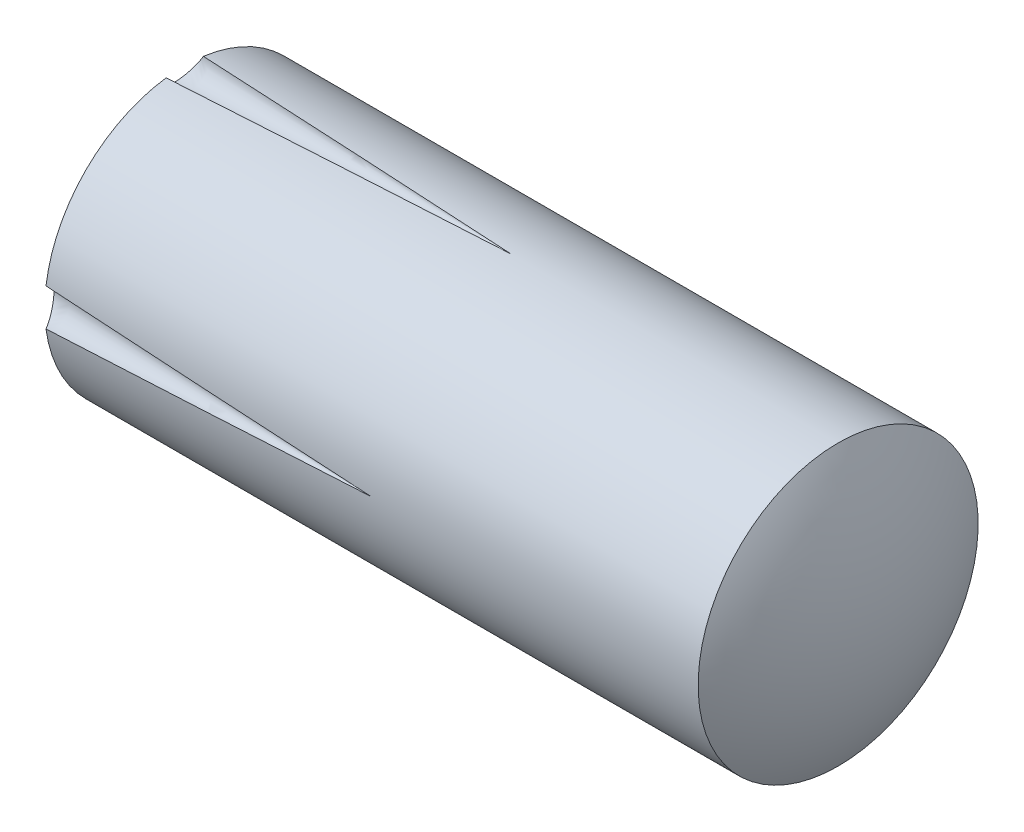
ISO-10303-21;
HEADER;
FILE_DESCRIPTION(('STEP AP214'),'2;1');
FILE_NAME('part.step','',(''),(''),'','','');
FILE_SCHEMA(('AUTOMOTIVE_DESIGN { 1 0 10303 214 1 1 1 1 }'));
ENDSEC;
DATA;
#1=APPLICATION_CONTEXT('core data for automotive mechanical design processes');
#2=APPLICATION_PROTOCOL_DEFINITION('international standard','automotive_design',2000,#1);
#3=PRODUCT_CONTEXT('',#1,'mechanical');
#4=PRODUCT('Part','Part','',(#3));
#5=PRODUCT_RELATED_PRODUCT_CATEGORY('part','',(#4));
#6=PRODUCT_DEFINITION_FORMATION('','',#4);
#7=PRODUCT_DEFINITION_CONTEXT('part definition',#1,'design');
#8=PRODUCT_DEFINITION('design','',#6,#7);
#9=PRODUCT_DEFINITION_SHAPE('','',#8);
#10=(LENGTH_UNIT() NAMED_UNIT(*) SI_UNIT(.MILLI.,.METRE.));
#11=(NAMED_UNIT(*) PLANE_ANGLE_UNIT() SI_UNIT($,.RADIAN.));
#12=(NAMED_UNIT(*) SI_UNIT($,.STERADIAN.) SOLID_ANGLE_UNIT());
#13=UNCERTAINTY_MEASURE_WITH_UNIT(LENGTH_MEASURE(1.E-05),#10,'distance_accuracy_value','');
#14=(GEOMETRIC_REPRESENTATION_CONTEXT(3) GLOBAL_UNCERTAINTY_ASSIGNED_CONTEXT((#13)) GLOBAL_UNIT_ASSIGNED_CONTEXT((#10,
#11,#12)) REPRESENTATION_CONTEXT('',''));
#15=CARTESIAN_POINT('',(0.,0.,0.));
#16=DIRECTION('',(0.,0.,1.));
#17=DIRECTION('',(1.,0.,0.));
#18=AXIS2_PLACEMENT_3D('',#15,#16,#17);
#19=CARTESIAN_POINT('',(6.025,0.,0.));
#20=DIRECTION('',(-1.,0.,0.));
#21=DIRECTION('',(0.,-1.,0.));
#22=AXIS2_PLACEMENT_3D('',#19,#20,#21);
#23=SPHERICAL_SURFACE('',#22,6.025);
#24=CARTESIAN_POINT('',(0.8002,0.399121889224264,2.97368318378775));
#25=CARTESIAN_POINT('',(0.784243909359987,0.398208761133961,2.9457787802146));
#26=CARTESIAN_POINT('',(0.768363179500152,0.394336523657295,2.91786604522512));
#27=CARTESIAN_POINT('',(0.737251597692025,0.380658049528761,2.86294908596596));
#28=CARTESIAN_POINT('',(0.722024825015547,0.370819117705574,2.83595073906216));
#29=CARTESIAN_POINT('',(0.694431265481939,0.346540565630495,2.78682879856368));
#30=CARTESIAN_POINT('',(0.681931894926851,0.332689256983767,2.76449063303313));
#31=CARTESIAN_POINT('',(0.658520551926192,0.300392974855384,2.72252113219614));
#32=CARTESIAN_POINT('',(0.64760445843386,0.281960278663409,2.70288277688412));
#33=CARTESIAN_POINT('',(0.628990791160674,0.243187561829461,2.66931232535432));
#34=CARTESIAN_POINT('',(0.621069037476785,0.223297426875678,2.65498639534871));
#35=CARTESIAN_POINT('',(0.607280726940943,0.180683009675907,2.63000991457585));
#36=CARTESIAN_POINT('',(0.601412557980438,0.157960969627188,2.61935648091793));
#37=CARTESIAN_POINT('',(0.592733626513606,0.113766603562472,2.60358467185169));
#38=CARTESIAN_POINT('',(0.589612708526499,0.0925544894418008,2.59790536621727));
#39=CARTESIAN_POINT('',(0.585326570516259,0.0492990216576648,2.59010310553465));
#40=CARTESIAN_POINT('',(0.584159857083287,0.027256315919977,2.58797743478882));
#41=CARTESIAN_POINT('',(0.583858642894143,-0.0148569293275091,2.58742872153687));
#42=CARTESIAN_POINT('',(0.584547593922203,-0.0349229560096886,2.58868401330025));
#43=CARTESIAN_POINT('',(0.587555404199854,-0.0745172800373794,2.59416073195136));
#44=CARTESIAN_POINT('',(0.589874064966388,-0.0940456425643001,2.59838179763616));
#45=CARTESIAN_POINT('',(0.596010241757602,-0.131863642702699,2.60954055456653));
#46=CARTESIAN_POINT('',(0.599814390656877,-0.15016266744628,2.61645401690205));
#47=CARTESIAN_POINT('',(0.608770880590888,-0.185290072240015,2.63270764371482));
#48=CARTESIAN_POINT('',(0.613923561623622,-0.202118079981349,2.64204842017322));
#49=CARTESIAN_POINT('',(0.625780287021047,-0.235042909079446,2.66350424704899));
#50=CARTESIAN_POINT('',(0.632564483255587,-0.25101746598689,2.67576207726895));
#51=CARTESIAN_POINT('',(0.647238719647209,-0.280678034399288,2.70221717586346));
#52=CARTESIAN_POINT('',(0.655129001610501,-0.294363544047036,2.71641486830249));
#53=CARTESIAN_POINT('',(0.672743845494,-0.32070569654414,2.74803247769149));
#54=CARTESIAN_POINT('',(0.682574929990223,-0.333071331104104,2.7656352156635));
#55=CARTESIAN_POINT('',(0.703075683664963,-0.354685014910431,2.8022318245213));
#56=CARTESIAN_POINT('',(0.713746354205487,-0.363929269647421,2.82122735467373));
#57=CARTESIAN_POINT('',(0.736795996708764,-0.380031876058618,2.86212772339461));
#58=CARTESIAN_POINT('',(0.749237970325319,-0.38654863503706,2.88413121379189));
#59=CARTESIAN_POINT('',(0.774502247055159,-0.395717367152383,2.92864909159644));
#60=CARTESIAN_POINT('',(0.787323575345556,-0.398378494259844,2.95116213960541));
#61=CARTESIAN_POINT('',(0.800199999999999,-0.399121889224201,2.97368318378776));
#62=B_SPLINE_CURVE_WITH_KNOTS('',3,(#24,#25,#26,#27,#28,#29,#30,#31,#32,#33,#34,#35,#36,#37,#38,
#39,#40,#41,#42,#43,#44,#45,#46,#47,#48,#49,#50,#51,#52,#53,#54,#55,#56,#57,#58,#59,#60,#61),
.UNSPECIFIED.,.F.,.F.,(4,2,2,2,2,2,2,2,2,2,2,2,2,2,2,2,2,2,4),(0.,0.0964308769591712,
0.193394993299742,0.280224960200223,0.366824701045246,0.443653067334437,0.520420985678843,
0.586595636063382,0.652719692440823,0.712779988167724,0.772832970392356,0.832357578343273,
0.891897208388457,0.95538061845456,1.01887792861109,1.08955037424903,1.16030842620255,
1.23831777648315,1.31614161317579),.UNSPECIFIED.);
#63=CARTESIAN_POINT('',(0.800000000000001,0.399110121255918,2.97333333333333));
#64=VERTEX_POINT('',#63);
#65=CARTESIAN_POINT('',(0.8,-0.399110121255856,2.97333333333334));
#66=VERTEX_POINT('',#65);
#67=EDGE_CURVE('E52',#64,#66,#62,.T.);
#68=ORIENTED_EDGE('',*,*,#67,.F.);
#69=CARTESIAN_POINT('',(0.8,0.,0.));
#70=DIRECTION('',(-1.,0.,0.));
#71=DIRECTION('',(0.,-1.,0.));
#72=AXIS2_PLACEMENT_3D('',#69,#70,#71);
#73=CIRCLE('',#72,3.);
#74=CARTESIAN_POINT('',(0.8,2.97333333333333,0.399110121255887));
#75=VERTEX_POINT('',#74);
#76=EDGE_CURVE('E97',#64,#75,#73,.T.);
#77=ORIENTED_EDGE('',*,*,#76,.T.);
#78=CARTESIAN_POINT('',(0.8002,2.97368318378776,-0.399121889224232));
#79=CARTESIAN_POINT('',(0.784243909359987,2.94577878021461,-0.39820876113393));
#80=CARTESIAN_POINT('',(0.768363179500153,2.91786604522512,-0.394336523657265));
#81=CARTESIAN_POINT('',(0.737251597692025,2.86294908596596,-0.380658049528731));
#82=CARTESIAN_POINT('',(0.722024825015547,2.83595073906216,-0.370819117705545));
#83=CARTESIAN_POINT('',(0.694431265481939,2.78682879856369,-0.346540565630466));
#84=CARTESIAN_POINT('',(0.681931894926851,2.76449063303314,-0.332689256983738));
#85=CARTESIAN_POINT('',(0.658520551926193,2.72252113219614,-0.300392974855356));
#86=CARTESIAN_POINT('',(0.64760445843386,2.70288277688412,-0.28196027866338));
#87=CARTESIAN_POINT('',(0.628990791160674,2.66931232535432,-0.243187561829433));
#88=CARTESIAN_POINT('',(0.621069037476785,2.65498639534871,-0.22329742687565));
#89=CARTESIAN_POINT('',(0.607280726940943,2.63000991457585,-0.18068300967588));
#90=CARTESIAN_POINT('',(0.601412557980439,2.61935648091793,-0.157960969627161));
#91=CARTESIAN_POINT('',(0.592733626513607,2.60358467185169,-0.113766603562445));
#92=CARTESIAN_POINT('',(0.5896127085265,2.59790536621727,-0.0925544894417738));
#93=CARTESIAN_POINT('',(0.58532657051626,2.59010310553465,-0.0492990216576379));
#94=CARTESIAN_POINT('',(0.584159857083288,2.58797743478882,-0.0272563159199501));
#95=CARTESIAN_POINT('',(0.583858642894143,2.58742872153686,0.0148569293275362));
#96=CARTESIAN_POINT('',(0.584547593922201,2.58868401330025,0.0349229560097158));
#97=CARTESIAN_POINT('',(0.587555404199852,2.59416073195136,0.0745172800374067));
#98=CARTESIAN_POINT('',(0.589874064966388,2.59838179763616,0.0940456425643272));
#99=CARTESIAN_POINT('',(0.596010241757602,2.60954055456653,0.131863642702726));
#100=CARTESIAN_POINT('',(0.599814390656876,2.61645401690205,0.150162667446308));
#101=CARTESIAN_POINT('',(0.608770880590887,2.63270764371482,0.185290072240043));
#102=CARTESIAN_POINT('',(0.613923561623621,2.64204842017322,0.202118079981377));
#103=CARTESIAN_POINT('',(0.625780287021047,2.66350424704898,0.235042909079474));
#104=CARTESIAN_POINT('',(0.632564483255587,2.67576207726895,0.251017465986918));
#105=CARTESIAN_POINT('',(0.647238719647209,2.70221717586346,0.280678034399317));
#106=CARTESIAN_POINT('',(0.655129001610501,2.71641486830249,0.294363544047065));
#107=CARTESIAN_POINT('',(0.672743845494,2.74803247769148,0.320705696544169));
#108=CARTESIAN_POINT('',(0.682574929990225,2.7656352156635,0.333071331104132));
#109=CARTESIAN_POINT('',(0.703075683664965,2.8022318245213,0.354685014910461));
#110=CARTESIAN_POINT('',(0.713746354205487,2.82122735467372,0.36392926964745));
#111=CARTESIAN_POINT('',(0.736795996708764,2.8621277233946,0.380031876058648));
#112=CARTESIAN_POINT('',(0.749237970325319,2.88413121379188,0.38654863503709));
#113=CARTESIAN_POINT('',(0.77450224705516,2.92864909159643,0.395717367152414));
#114=CARTESIAN_POINT('',(0.787323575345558,2.95116213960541,0.398378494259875));
#115=CARTESIAN_POINT('',(0.800200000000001,2.97368318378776,0.399121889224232));
#116=B_SPLINE_CURVE_WITH_KNOTS('',3,(#78,#79,#80,#81,#82,#83,#84,#85,#86,#87,#88,#89,#90,#91,
#92,#93,#94,#95,#96,#97,#98,#99,#100,#101,#102,#103,#104,#105,#106,#107,#108,#109,#110,#111,
#112,#113,#114,#115),.UNSPECIFIED.,.F.,.F.,(4,2,2,2,2,2,2,2,2,2,2,2,2,2,2,2,2,2,4),(0.,
0.0964308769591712,0.193394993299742,0.280224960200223,0.366824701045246,0.443653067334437,
0.520420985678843,0.586595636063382,0.652719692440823,0.712779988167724,0.772832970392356,
0.832357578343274,0.891897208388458,0.955380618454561,1.01887792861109,1.08955037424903,
1.16030842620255,1.23831777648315,1.3161416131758),.UNSPECIFIED.);
#117=CARTESIAN_POINT('',(0.8,2.97333333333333,-0.399110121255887));
#118=VERTEX_POINT('',#117);
#119=EDGE_CURVE('E109',#118,#75,#116,.T.);
#120=ORIENTED_EDGE('',*,*,#119,.F.);
#121=CARTESIAN_POINT('',(0.8,0.399110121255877,-2.97333333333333));
#122=VERTEX_POINT('',#121);
#123=EDGE_CURVE('E106',#118,#122,#73,.T.);
#124=ORIENTED_EDGE('',*,*,#123,.T.);
#125=CARTESIAN_POINT('',(0.8002,-0.399121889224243,-2.97368318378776));
#126=CARTESIAN_POINT('',(0.784243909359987,-0.398208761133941,-2.94577878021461));
#127=CARTESIAN_POINT('',(0.768363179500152,-0.394336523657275,-2.91786604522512));
#128=CARTESIAN_POINT('',(0.737251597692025,-0.380658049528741,-2.86294908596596));
#129=CARTESIAN_POINT('',(0.722024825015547,-0.370819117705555,-2.83595073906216));
#130=CARTESIAN_POINT('',(0.694431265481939,-0.346540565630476,-2.78682879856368));
#131=CARTESIAN_POINT('',(0.681931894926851,-0.332689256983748,-2.76449063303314));
#132=CARTESIAN_POINT('',(0.658520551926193,-0.300392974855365,-2.72252113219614));
#133=CARTESIAN_POINT('',(0.647604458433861,-0.28196027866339,-2.70288277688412));
#134=CARTESIAN_POINT('',(0.628990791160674,-0.243187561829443,-2.66931232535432));
#135=CARTESIAN_POINT('',(0.621069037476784,-0.22329742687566,-2.65498639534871));
#136=CARTESIAN_POINT('',(0.607280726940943,-0.180683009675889,-2.63000991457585));
#137=CARTESIAN_POINT('',(0.60141255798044,-0.15796096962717,-2.61935648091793));
#138=CARTESIAN_POINT('',(0.592733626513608,-0.113766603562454,-2.60358467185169));
#139=CARTESIAN_POINT('',(0.589612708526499,-0.0925544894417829,-2.59790536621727));
#140=CARTESIAN_POINT('',(0.585326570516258,-0.0492990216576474,-2.59010310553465));
#141=CARTESIAN_POINT('',(0.584159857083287,-0.0272563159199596,-2.58797743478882));
#142=CARTESIAN_POINT('',(0.583858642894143,0.0148569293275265,-2.58742872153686));
#143=CARTESIAN_POINT('',(0.584547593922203,0.034922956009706,-2.58868401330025));
#144=CARTESIAN_POINT('',(0.587555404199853,0.0745172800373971,-2.59416073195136));
#145=CARTESIAN_POINT('',(0.589874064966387,0.0940456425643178,-2.59838179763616));
#146=CARTESIAN_POINT('',(0.596010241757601,0.131863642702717,-2.60954055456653));
#147=CARTESIAN_POINT('',(0.599814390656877,0.150162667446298,-2.61645401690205));
#148=CARTESIAN_POINT('',(0.608770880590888,0.185290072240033,-2.63270764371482));
#149=CARTESIAN_POINT('',(0.613923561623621,0.202118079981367,-2.64204842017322));
#150=CARTESIAN_POINT('',(0.625780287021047,0.235042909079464,-2.66350424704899));
#151=CARTESIAN_POINT('',(0.632564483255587,0.251017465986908,-2.67576207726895));
#152=CARTESIAN_POINT('',(0.64723871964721,0.280678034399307,-2.70221717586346));
#153=CARTESIAN_POINT('',(0.655129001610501,0.294363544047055,-2.71641486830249));
#154=CARTESIAN_POINT('',(0.672743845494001,0.32070569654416,-2.74803247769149));
#155=CARTESIAN_POINT('',(0.682574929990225,0.333071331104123,-2.7656352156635));
#156=CARTESIAN_POINT('',(0.703075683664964,0.354685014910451,-2.8022318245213));
#157=CARTESIAN_POINT('',(0.713746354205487,0.363929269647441,-2.82122735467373));
#158=CARTESIAN_POINT('',(0.736795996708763,0.380031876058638,-2.8621277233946));
#159=CARTESIAN_POINT('',(0.749237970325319,0.38654863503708,-2.88413121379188));
#160=CARTESIAN_POINT('',(0.77450224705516,0.395717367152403,-2.92864909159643));
#161=CARTESIAN_POINT('',(0.787323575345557,0.398378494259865,-2.95116213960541));
#162=CARTESIAN_POINT('',(0.8002,0.399121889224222,-2.97368318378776));
#163=B_SPLINE_CURVE_WITH_KNOTS('',3,(#125,#126,#127,#128,#129,#130,#131,#132,#133,#134,#135,
#136,#137,#138,#139,#140,#141,#142,#143,#144,#145,#146,#147,#148,#149,#150,#151,#152,#153,#154,
#155,#156,#157,#158,#159,#160,#161,#162),.UNSPECIFIED.,.F.,.F.,(4,2,2,2,2,2,2,2,2,2,2,2,2,2,2,2,
2,2,4),(0.,0.096430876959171,0.193394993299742,0.280224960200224,0.366824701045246,
0.443653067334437,0.520420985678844,0.586595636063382,0.652719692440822,0.712779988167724,
0.772832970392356,0.832357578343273,0.891897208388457,0.955380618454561,1.01887792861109,
1.08955037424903,1.16030842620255,1.23831777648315,1.3161416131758),.UNSPECIFIED.);
#164=CARTESIAN_POINT('',(0.8,-0.399110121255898,-2.97333333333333));
#165=VERTEX_POINT('',#164);
#166=EDGE_CURVE('E118',#165,#122,#163,.T.);
#167=ORIENTED_EDGE('',*,*,#166,.F.);
#168=CARTESIAN_POINT('',(0.8,-2.97333333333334,-0.399110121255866));
#169=VERTEX_POINT('',#168);
#170=EDGE_CURVE('E107',#165,#169,#73,.T.);
#171=ORIENTED_EDGE('',*,*,#170,.T.);
#172=CARTESIAN_POINT('',(0.8002,-2.97368318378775,0.399121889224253));
#173=CARTESIAN_POINT('',(0.784243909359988,-2.9457787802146,0.398208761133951));
#174=CARTESIAN_POINT('',(0.768363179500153,-2.91786604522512,0.394336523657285));
#175=CARTESIAN_POINT('',(0.737251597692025,-2.86294908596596,0.380658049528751));
#176=CARTESIAN_POINT('',(0.722024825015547,-2.83595073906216,0.370819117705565));
#177=CARTESIAN_POINT('',(0.694431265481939,-2.78682879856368,0.346540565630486));
#178=CARTESIAN_POINT('',(0.681931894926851,-2.76449063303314,0.332689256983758));
#179=CARTESIAN_POINT('',(0.658520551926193,-2.72252113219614,0.300392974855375));
#180=CARTESIAN_POINT('',(0.64760445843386,-2.70288277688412,0.2819602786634));
#181=CARTESIAN_POINT('',(0.628990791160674,-2.66931232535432,0.243187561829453));
#182=CARTESIAN_POINT('',(0.621069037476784,-2.65498639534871,0.22329742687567));
#183=CARTESIAN_POINT('',(0.607280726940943,-2.63000991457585,0.180683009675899));
#184=CARTESIAN_POINT('',(0.601412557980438,-2.61935648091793,0.15796096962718));
#185=CARTESIAN_POINT('',(0.592733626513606,-2.60358467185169,0.113766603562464));
#186=CARTESIAN_POINT('',(0.5896127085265,-2.59790536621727,0.0925544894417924));
#187=CARTESIAN_POINT('',(0.58532657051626,-2.59010310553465,0.0492990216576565));
#188=CARTESIAN_POINT('',(0.584159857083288,-2.58797743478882,0.0272563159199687));
#189=CARTESIAN_POINT('',(0.583858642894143,-2.58742872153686,-0.0148569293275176));
#190=CARTESIAN_POINT('',(0.584547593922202,-2.58868401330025,-0.0349229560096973));
#191=CARTESIAN_POINT('',(0.587555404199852,-2.59416073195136,-0.0745172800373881));
#192=CARTESIAN_POINT('',(0.589874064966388,-2.59838179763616,-0.0940456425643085));
#193=CARTESIAN_POINT('',(0.596010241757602,-2.60954055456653,-0.131863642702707));
#194=CARTESIAN_POINT('',(0.599814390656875,-2.61645401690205,-0.150162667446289));
#195=CARTESIAN_POINT('',(0.608770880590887,-2.63270764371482,-0.185290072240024));
#196=CARTESIAN_POINT('',(0.613923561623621,-2.64204842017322,-0.202118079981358));
#197=CARTESIAN_POINT('',(0.625780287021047,-2.66350424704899,-0.235042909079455));
#198=CARTESIAN_POINT('',(0.632564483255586,-2.67576207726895,-0.251017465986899));
#199=CARTESIAN_POINT('',(0.647238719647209,-2.70221717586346,-0.280678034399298));
#200=CARTESIAN_POINT('',(0.655129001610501,-2.71641486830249,-0.294363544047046));
#201=CARTESIAN_POINT('',(0.672743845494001,-2.74803247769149,-0.32070569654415));
#202=CARTESIAN_POINT('',(0.682574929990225,-2.7656352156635,-0.333071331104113));
#203=CARTESIAN_POINT('',(0.703075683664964,-2.8022318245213,-0.354685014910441));
#204=CARTESIAN_POINT('',(0.713746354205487,-2.82122735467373,-0.363929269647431));
#205=CARTESIAN_POINT('',(0.736795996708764,-2.8621277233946,-0.380031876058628));
#206=CARTESIAN_POINT('',(0.74923797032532,-2.88413121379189,-0.38654863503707));
#207=CARTESIAN_POINT('',(0.77450224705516,-2.92864909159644,-0.395717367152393));
#208=CARTESIAN_POINT('',(0.787323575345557,-2.95116213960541,-0.398378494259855));
#209=CARTESIAN_POINT('',(0.8002,-2.97368318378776,-0.399121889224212));
#210=B_SPLINE_CURVE_WITH_KNOTS('',3,(#172,#173,#174,#175,#176,#177,#178,#179,#180,#181,#182,
#183,#184,#185,#186,#187,#188,#189,#190,#191,#192,#193,#194,#195,#196,#197,#198,#199,#200,#201,
#202,#203,#204,#205,#206,#207,#208,#209),.UNSPECIFIED.,.F.,.F.,(4,2,2,2,2,2,2,2,2,2,2,2,2,2,2,2,
2,2,4),(0.,0.0964308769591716,0.193394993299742,0.280224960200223,0.366824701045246,
0.443653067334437,0.520420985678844,0.586595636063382,0.652719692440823,0.712779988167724,
0.772832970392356,0.832357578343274,0.891897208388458,0.955380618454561,1.01887792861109,
1.08955037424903,1.16030842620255,1.23831777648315,1.3161416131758),.UNSPECIFIED.);
#211=CARTESIAN_POINT('',(0.8,-2.97333333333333,0.399110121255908));
#212=VERTEX_POINT('',#211);
#213=EDGE_CURVE('E60',#212,#169,#210,.T.);
#214=ORIENTED_EDGE('',*,*,#213,.F.);
#215=EDGE_CURVE('E103',#212,#66,#73,.T.);
#216=ORIENTED_EDGE('',*,*,#215,.T.);
#217=EDGE_LOOP('',(#68,#77,#120,#124,#167,#171,#214,#216));
#218=FACE_BOUND('',#217,.T.);
#219=ADVANCED_FACE('F34',(#218),#23,.T.);
#220=CARTESIAN_POINT('',(0.,0.,0.));
#221=DIRECTION('',(-1.,0.,0.));
#222=DIRECTION('',(0.,-1.,0.));
#223=AXIS2_PLACEMENT_3D('',#220,#221,#222);
#224=CYLINDRICAL_SURFACE('',#223,3.);
#225=CARTESIAN_POINT('',(7.80000000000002,0.,3.));
#226=CARTESIAN_POINT('',(7.79994129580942,3.35452521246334E-06,3.00000000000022));
#227=CARTESIAN_POINT('',(7.79988259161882,6.70905039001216E-06,2.99999999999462));
#228=CARTESIAN_POINT('',(7.79976589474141,1.33774433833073E-05,2.99999999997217));
#229=CARTESIAN_POINT('',(7.7997079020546,1.66913111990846E-05,2.99999999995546));
#230=CARTESIAN_POINT('',(7.79953321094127,2.66736605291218E-05,2.99999999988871));
#231=CARTESIAN_POINT('',(7.79941651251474,3.33421420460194E-05,2.99999999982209));
#232=CARTESIAN_POINT('',(7.79906641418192,5.33477610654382E-05,2.9999999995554));
#233=CARTESIAN_POINT('',(7.79883301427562,6.66848985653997E-05,2.99999999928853));
#234=CARTESIAN_POINT('',(7.79813280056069,0.000106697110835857,2.99999999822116));
#235=CARTESIAN_POINT('',(7.79766598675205,0.000133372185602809,2.99999999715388));
#236=CARTESIAN_POINT('',(7.79626548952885,0.000213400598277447,2.9999999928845));
#237=CARTESIAN_POINT('',(7.7953318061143,0.000266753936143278,2.99999998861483));
#238=CARTESIAN_POINT('',(7.79253053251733,0.000426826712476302,2.99999997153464));
#239=CARTESIAN_POINT('',(7.79066294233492,0.000533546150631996,2.99999995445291));
#240=CARTESIAN_POINT('',(7.78505927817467,0.000853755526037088,2.99999988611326));
#241=CARTESIAN_POINT('',(7.78132320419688,0.00106724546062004,2.99999981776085));
#242=CARTESIAN_POINT('',(7.77011140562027,0.00170791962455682,2.99999954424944));
#243=CARTESIAN_POINT('',(7.76263568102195,0.00213510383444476,2.99999927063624));
#244=CARTESIAN_POINT('',(7.74019418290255,0.00341747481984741,2.99999817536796));
#245=CARTESIAN_POINT('',(7.72522840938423,0.0042726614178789,2.99999707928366));
#246=CARTESIAN_POINT('',(7.68027364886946,0.00684150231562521,2.9999926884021));
#247=CARTESIAN_POINT('',(7.65028466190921,0.00855515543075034,2.99998829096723));
#248=CARTESIAN_POINT('',(7.5600867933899,0.0137092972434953,2.99997064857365));
#249=CARTESIAN_POINT('',(7.49987791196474,0.0171497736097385,2.99995295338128));
#250=CARTESIAN_POINT('',(7.31831839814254,0.0275244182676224,2.99988174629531));
#251=CARTESIAN_POINT('',(7.19696776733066,0.0344584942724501,2.99981011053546));
#252=CARTESIAN_POINT('',(6.82910858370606,0.0554775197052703,2.99952007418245));
#253=CARTESIAN_POINT('',(6.58260004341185,0.0695616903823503,2.99922650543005));
#254=CARTESIAN_POINT('',(5.82721079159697,0.112714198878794,2.99802289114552));
#255=CARTESIAN_POINT('',(5.3183301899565,0.141775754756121,2.9967892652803));
#256=CARTESIAN_POINT('',(3.72266159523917,0.232845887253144,2.99159532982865));
#257=CARTESIAN_POINT('',(2.63587462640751,0.29479016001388,2.9861294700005));
#258=CARTESIAN_POINT('',(-0.803942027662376,0.490304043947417,2.96272596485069));
#259=CARTESIAN_POINT('',(-3.15696158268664,0.623235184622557,2.93767712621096));
#260=CARTESIAN_POINT('',(-5.50995369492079,0.754433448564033,2.90358918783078));
#261=B_SPLINE_CURVE_WITH_KNOTS('',3,(#225,#226,#227,#228,#229,#230,#231,#232,#233,#234,#235,
#236,#237,#238,#239,#240,#241,#242,#243,#244,#245,#246,#247,#248,#249,#250,#251,#252,#253,#254,
#255,#256,#257,#258,#259,#260),.UNSPECIFIED.,.F.,.F.,(4,2,2,2,2,2,2,2,2,2,2,2,2,2,2,2,2,4),(0.,
0.00017639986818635,0.000350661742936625,0.000701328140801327,0.00140267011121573,
0.00280539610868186,0.00561101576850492,0.0112229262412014,0.0224494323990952,
0.0449131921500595,0.0898837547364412,0.179997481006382,0.360918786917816,0.725564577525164,
1.46629670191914,2.99542979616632,6.2611169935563,13.3317642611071),.UNSPECIFIED.);
#262=CARTESIAN_POINT('',(7.8,0.,3.));
#263=VERTEX_POINT('',#262);
#264=EDGE_CURVE('E11',#263,#64,#261,.T.);
#265=ORIENTED_EDGE('',*,*,#264,.F.);
#266=CARTESIAN_POINT('',(7.80000000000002,0.,3.));
#267=CARTESIAN_POINT('',(7.79994129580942,-3.35452514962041E-06,3.00000000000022));
#268=CARTESIAN_POINT('',(7.79988259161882,-6.70905032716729E-06,2.99999999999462));
#269=CARTESIAN_POINT('',(7.79976589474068,-1.33774433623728E-05,2.99999999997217));
#270=CARTESIAN_POINT('',(7.79970790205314,-1.66913112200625E-05,2.99999999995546));
#271=CARTESIAN_POINT('',(7.79953321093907,-2.66736605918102E-05,2.99999999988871));
#272=CARTESIAN_POINT('',(7.79941651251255,-3.33421421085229E-05,2.99999999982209));
#273=CARTESIAN_POINT('',(7.79906641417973,-5.33477611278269E-05,2.9999999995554));
#274=CARTESIAN_POINT('',(7.79883301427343,-6.66848986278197E-05,2.99999999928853));
#275=CARTESIAN_POINT('',(7.79813280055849,-0.00010669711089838,2.99999999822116));
#276=CARTESIAN_POINT('',(7.79766598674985,-0.000133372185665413,2.99999999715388));
#277=CARTESIAN_POINT('',(7.79626548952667,-0.000213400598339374,2.9999999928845));
#278=CARTESIAN_POINT('',(7.79533180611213,-0.000266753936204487,2.99999998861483));
#279=CARTESIAN_POINT('',(7.79253053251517,-0.000426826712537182,2.99999997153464));
#280=CARTESIAN_POINT('',(7.79066294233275,-0.00053354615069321,2.99999995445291));
#281=CARTESIAN_POINT('',(7.78505927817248,-0.000853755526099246,2.99999988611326));
#282=CARTESIAN_POINT('',(7.78132320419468,-0.00106724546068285,2.99999981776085));
#283=CARTESIAN_POINT('',(7.77011140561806,-0.00170791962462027,2.99999954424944));
#284=CARTESIAN_POINT('',(7.76263568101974,-0.00213510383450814,2.99999927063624));
#285=CARTESIAN_POINT('',(7.74019418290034,-0.00341747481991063,2.99999817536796));
#286=CARTESIAN_POINT('',(7.72522840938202,-0.00427266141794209,2.99999707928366));
#287=CARTESIAN_POINT('',(7.6802736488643,-0.0068415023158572,2.9999926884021));
#288=CARTESIAN_POINT('',(7.6502846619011,-0.00855515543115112,2.99998829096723));
#289=CARTESIAN_POINT('',(7.56008679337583,-0.013709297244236,2.99997064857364));
#290=CARTESIAN_POINT('',(7.49987791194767,-0.0171497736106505,2.99995295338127));
#291=CARTESIAN_POINT('',(7.31831839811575,-0.0275244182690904,2.99988174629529));
#292=CARTESIAN_POINT('',(7.19696776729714,-0.0344584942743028,2.99981011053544));
#293=CARTESIAN_POINT('',(6.82910858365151,-0.0554775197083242,2.9995200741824));
#294=CARTESIAN_POINT('',(6.582600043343,-0.0695616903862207,2.99922650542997));
#295=CARTESIAN_POINT('',(5.82721079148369,-0.112714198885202,2.9980228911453));
#296=CARTESIAN_POINT('',(5.31833018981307,-0.141775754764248,2.99678926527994));
#297=CARTESIAN_POINT('',(3.72266159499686,-0.232845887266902,2.99159532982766));
#298=CARTESIAN_POINT('',(2.63587462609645,-0.294790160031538,2.98612946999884));
#299=CARTESIAN_POINT('',(-0.803942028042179,-0.490304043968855,2.96272596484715));
#300=CARTESIAN_POINT('',(-3.15696158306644,-0.623235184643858,2.93767712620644));
#301=CARTESIAN_POINT('',(-5.50995369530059,-0.754433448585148,2.90358918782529));
#302=B_SPLINE_CURVE_WITH_KNOTS('',3,(#266,#267,#268,#269,#270,#271,#272,#273,#274,#275,#276,
#277,#278,#279,#280,#281,#282,#283,#284,#285,#286,#287,#288,#289,#290,#291,#292,#293,#294,#295,
#296,#297,#298,#299,#300,#301),.UNSPECIFIED.,.F.,.F.,(4,2,2,2,2,2,2,2,2,2,2,2,2,2,2,2,2,4),(0.,
0.00017639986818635,0.000350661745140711,0.000701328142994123,0.00140267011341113,
0.00280539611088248,0.00561101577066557,0.0112229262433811,0.022449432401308,0.0449131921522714,
0.0898837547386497,0.179997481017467,0.360918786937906,0.725564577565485,1.46629670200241,
2.99542979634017,6.26111699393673,13.3317642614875),.UNSPECIFIED.);
#303=EDGE_CURVE('E46',#66,#263,#302,.F.);
#304=ORIENTED_EDGE('',*,*,#303,.F.);
#305=ORIENTED_EDGE('',*,*,#215,.F.);
#306=CARTESIAN_POINT('',(7.80000000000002,-3.,0.));
#307=CARTESIAN_POINT('',(7.79994129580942,-3.00000000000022,3.35452520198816E-06));
#308=CARTESIAN_POINT('',(7.79988259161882,-2.99999999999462,6.70905037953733E-06));
#309=CARTESIAN_POINT('',(7.7997658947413,-2.99999999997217,1.33774433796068E-05));
#310=CARTESIAN_POINT('',(7.79970790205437,-2.99999999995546,1.66913112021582E-05));
#311=CARTESIAN_POINT('',(7.7995332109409,-2.99999999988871,2.66736605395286E-05));
#312=CARTESIAN_POINT('',(7.79941651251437,-2.99999999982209,3.33421420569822E-05));
#313=CARTESIAN_POINT('',(7.79906641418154,-2.9999999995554,5.33477610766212E-05));
#314=CARTESIAN_POINT('',(7.79883301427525,-2.99999999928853,6.66848985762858E-05));
#315=CARTESIAN_POINT('',(7.79813280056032,-2.99999999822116,0.000106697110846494));
#316=CARTESIAN_POINT('',(7.79766598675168,-2.99999999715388,0.000133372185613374));
#317=CARTESIAN_POINT('',(7.7962654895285,-2.9999999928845,0.000213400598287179));
#318=CARTESIAN_POINT('',(7.79533180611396,-2.99999998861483,0.000266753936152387));
#319=CARTESIAN_POINT('',(7.79253053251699,-2.99999997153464,0.000426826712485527));
#320=CARTESIAN_POINT('',(7.79066294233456,-2.99999995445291,0.000533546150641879));
#321=CARTESIAN_POINT('',(7.7850592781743,-2.99999988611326,0.000853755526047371));
#322=CARTESIAN_POINT('',(7.78132320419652,-2.99999981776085,0.00106724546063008));
#323=CARTESIAN_POINT('',(7.77011140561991,-2.99999954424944,0.0017079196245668));
#324=CARTESIAN_POINT('',(7.76263568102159,-2.99999927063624,0.00213510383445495));
#325=CARTESIAN_POINT('',(7.74019418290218,-2.99999817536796,0.00341747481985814));
#326=CARTESIAN_POINT('',(7.72522840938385,-2.99999707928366,0.00427266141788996));
#327=CARTESIAN_POINT('',(7.68027364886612,-2.9999926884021,0.00684150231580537));
#328=CARTESIAN_POINT('',(7.65028466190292,-2.99998829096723,0.00855515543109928));
#329=CARTESIAN_POINT('',(7.56008679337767,-2.99997064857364,0.0137092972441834));
#330=CARTESIAN_POINT('',(7.49987791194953,-2.99995295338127,0.0171497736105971));
#331=CARTESIAN_POINT('',(7.31831839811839,-2.99988174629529,0.0275244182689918));
#332=CARTESIAN_POINT('',(7.19696776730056,-2.99981011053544,0.03445849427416));
#333=CARTESIAN_POINT('',(6.82910858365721,-2.9995200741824,0.0554775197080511));
#334=CARTESIAN_POINT('',(6.58260004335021,-2.99922650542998,0.0695616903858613));
#335=CARTESIAN_POINT('',(5.82721079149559,-2.99802289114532,0.112714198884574));
#336=CARTESIAN_POINT('',(5.31833018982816,-2.99678926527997,0.141775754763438));
#337=CARTESIAN_POINT('',(3.72266159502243,-2.99159532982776,0.232845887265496));
#338=CARTESIAN_POINT('',(2.63587462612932,-2.98612946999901,0.294790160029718));
#339=CARTESIAN_POINT('',(-0.803942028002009,-2.96272596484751,0.490304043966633));
#340=CARTESIAN_POINT('',(-3.15696158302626,-2.93767712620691,0.62323518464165));
#341=CARTESIAN_POINT('',(-5.50995369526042,-2.90358918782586,0.754433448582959));
#342=B_SPLINE_CURVE_WITH_KNOTS('',3,(#306,#307,#308,#309,#310,#311,#312,#313,#314,#315,#316,
#317,#318,#319,#320,#321,#322,#323,#324,#325,#326,#327,#328,#329,#330,#331,#332,#333,#334,#335,
#336,#337,#338,#339,#340,#341),.UNSPECIFIED.,.F.,.F.,(4,2,2,2,2,2,2,2,2,2,2,2,2,2,2,2,2,4),(0.,
0.00017639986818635,0.000350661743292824,0.000701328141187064,0.00140267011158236,
0.00280539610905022,0.00561101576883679,0.0112229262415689,0.0224494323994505,
0.0449131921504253,0.0898837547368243,0.17999748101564,0.360918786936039,0.725564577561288,
1.46629670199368,2.99542979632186,6.26111699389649,13.3317642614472),.UNSPECIFIED.);
#343=CARTESIAN_POINT('',(7.8,-3.,0.));
#344=VERTEX_POINT('',#343);
#345=EDGE_CURVE('E92',#344,#212,#342,.T.);
#346=ORIENTED_EDGE('',*,*,#345,.F.);
#347=CARTESIAN_POINT('',(7.80000000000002,-3.,0.));
#348=CARTESIAN_POINT('',(7.79994129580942,-3.00000000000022,-3.35452516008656E-06));
#349=CARTESIAN_POINT('',(7.79988259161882,-2.99999999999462,-6.70905033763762E-06));
#350=CARTESIAN_POINT('',(7.7997658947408,-2.99999999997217,-1.33774433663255E-05));
#351=CARTESIAN_POINT('',(7.79970790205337,-2.99999999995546,-1.66913112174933E-05));
#352=CARTESIAN_POINT('',(7.79953321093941,-2.99999999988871,-2.66736605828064E-05));
#353=CARTESIAN_POINT('',(7.79941651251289,-2.99999999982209,-3.33421420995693E-05));
#354=CARTESIAN_POINT('',(7.79906641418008,-2.9999999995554,-5.33477611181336E-05));
#355=CARTESIAN_POINT('',(7.7988330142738,-2.99999999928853,-6.66848986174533E-05));
#356=CARTESIAN_POINT('',(7.79813280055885,-2.99999999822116,-0.000106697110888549));
#357=CARTESIAN_POINT('',(7.79766598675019,-2.99999999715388,-0.000133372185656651));
#358=CARTESIAN_POINT('',(7.79626548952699,-2.9999999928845,-0.000213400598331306));
#359=CARTESIAN_POINT('',(7.79533180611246,-2.99999998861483,-0.000266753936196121));
#360=CARTESIAN_POINT('',(7.79253053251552,-2.99999997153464,-0.000426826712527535));
#361=CARTESIAN_POINT('',(7.79066294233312,-2.99999995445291,-0.00053354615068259));
#362=CARTESIAN_POINT('',(7.78505927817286,-2.99999988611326,-0.00085375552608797));
#363=CARTESIAN_POINT('',(7.78132320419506,-2.99999981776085,-0.0010672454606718));
#364=CARTESIAN_POINT('',(7.77011140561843,-2.99999954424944,-0.00170791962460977));
#365=CARTESIAN_POINT('',(7.7626356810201,-2.99999927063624,-0.00213510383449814));
#366=CARTESIAN_POINT('',(7.74019418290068,-2.99999817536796,-0.00341747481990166));
#367=CARTESIAN_POINT('',(7.72522840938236,-2.99999707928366,-0.00427266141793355));
#368=CARTESIAN_POINT('',(7.68027364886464,-2.9999926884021,-0.00684150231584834));
#369=CARTESIAN_POINT('',(7.65028466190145,-2.99998829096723,-0.00855515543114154));
#370=CARTESIAN_POINT('',(7.5600867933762,-2.99997064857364,-0.0137092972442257));
#371=CARTESIAN_POINT('',(7.49987791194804,-2.99995295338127,-0.0171497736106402));
#372=CARTESIAN_POINT('',(7.31831839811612,-2.99988174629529,-0.0275244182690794));
#373=CARTESIAN_POINT('',(7.19696776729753,-2.99981011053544,-0.0344584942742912));
#374=CARTESIAN_POINT('',(6.82910858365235,-2.9995200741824,-0.055477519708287));
#375=CARTESIAN_POINT('',(6.58260004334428,-2.99922650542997,-0.0695616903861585));
#376=CARTESIAN_POINT('',(5.82721079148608,-2.9980228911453,-0.112714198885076));
#377=CARTESIAN_POINT('',(5.31833018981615,-2.99678926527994,-0.141775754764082));
#378=CARTESIAN_POINT('',(3.72266159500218,-2.99159532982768,-0.232845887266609));
#379=CARTESIAN_POINT('',(2.63587462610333,-2.98612946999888,-0.294790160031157));
#380=CARTESIAN_POINT('',(-0.803942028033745,-2.96272596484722,-0.490304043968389));
#381=CARTESIAN_POINT('',(-3.156961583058,-2.93767712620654,-0.623235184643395));
#382=CARTESIAN_POINT('',(-5.50995369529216,-2.90358918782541,-0.754433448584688));
#383=B_SPLINE_CURVE_WITH_KNOTS('',3,(#347,#348,#349,#350,#351,#352,#353,#354,#355,#356,#357,
#358,#359,#360,#361,#362,#363,#364,#365,#366,#367,#368,#369,#370,#371,#372,#373,#374,#375,#376,
#377,#378,#379,#380,#381,#382),.UNSPECIFIED.,.F.,.F.,(4,2,2,2,2,2,2,2,2,2,2,2,2,2,2,2,2,4),(0.,
0.00017639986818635,0.000350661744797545,0.000701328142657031,0.00140267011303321,
0.0028053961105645,0.00561101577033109,0.0112229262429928,0.0224494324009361,0.0449131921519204,
0.089883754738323,0.179997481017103,0.360918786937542,0.725564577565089,1.4662967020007,
2.99542979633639,6.26111699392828,13.331764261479),.UNSPECIFIED.);
#384=EDGE_CURVE('E123',#169,#344,#383,.F.);
#385=ORIENTED_EDGE('',*,*,#384,.F.);
#386=ORIENTED_EDGE('',*,*,#170,.F.);
#387=CARTESIAN_POINT('',(7.80000000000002,0.,-3.));
#388=CARTESIAN_POINT('',(7.79994129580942,-3.35452519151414E-06,-3.00000000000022));
#389=CARTESIAN_POINT('',(7.79988259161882,-6.70905036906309E-06,-2.99999999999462));
#390=CARTESIAN_POINT('',(7.79976589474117,-1.3377443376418E-05,-2.99999999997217));
#391=CARTESIAN_POINT('',(7.79970790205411,-1.66913112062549E-05,-2.99999999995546));
#392=CARTESIAN_POINT('',(7.79953321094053,-2.66736605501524E-05,-2.99999999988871));
#393=CARTESIAN_POINT('',(7.79941651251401,-3.33421420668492E-05,-2.99999999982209));
#394=CARTESIAN_POINT('',(7.79906641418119,-5.33477610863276E-05,-2.9999999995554));
#395=CARTESIAN_POINT('',(7.79883301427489,-6.66848985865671E-05,-2.99999999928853));
#396=CARTESIAN_POINT('',(7.79813280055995,-0.000106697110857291,-2.99999999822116));
#397=CARTESIAN_POINT('',(7.79766598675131,-0.000133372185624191,-2.99999999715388));
#398=CARTESIAN_POINT('',(7.79626548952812,-0.000213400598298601,-2.9999999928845));
#399=CARTESIAN_POINT('',(7.79533180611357,-0.000266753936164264,-2.99999998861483));
#400=CARTESIAN_POINT('',(7.79253053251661,-0.000426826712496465,-2.99999997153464));
#401=CARTESIAN_POINT('',(7.79066294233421,-0.000533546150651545,-2.99999995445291));
#402=CARTESIAN_POINT('',(7.78505927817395,-0.000853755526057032,-2.99999988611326));
#403=CARTESIAN_POINT('',(7.78132320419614,-0.00106724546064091,-2.99999981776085));
#404=CARTESIAN_POINT('',(7.77011140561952,-0.00170791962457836,-2.99999954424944));
#405=CARTESIAN_POINT('',(7.76263568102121,-0.00213510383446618,-2.99999927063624));
#406=CARTESIAN_POINT('',(7.7401941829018,-0.00341747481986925,-2.99999817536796));
#407=CARTESIAN_POINT('',(7.72522840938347,-0.00427266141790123,-2.99999707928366));
#408=CARTESIAN_POINT('',(7.68027364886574,-0.00684150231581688,-2.9999926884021));
#409=CARTESIAN_POINT('',(7.65028466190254,-0.00855515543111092,-2.99998829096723));
#410=CARTESIAN_POINT('',(7.56008679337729,-0.0137092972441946,-2.99997064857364));
#411=CARTESIAN_POINT('',(7.49987791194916,-0.0171497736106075,-2.99995295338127));
#412=CARTESIAN_POINT('',(7.318318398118,-0.0275244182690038,-2.99988174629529));
#413=CARTESIAN_POINT('',(7.19696776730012,-0.0344584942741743,-2.99981011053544));
#414=CARTESIAN_POINT('',(6.82910858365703,-0.0554775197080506,-2.9995200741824));
#415=CARTESIAN_POINT('',(6.58260004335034,-0.0695616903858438,-2.99922650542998));
#416=CARTESIAN_POINT('',(5.82721079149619,-0.11271419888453,-2.99802289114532));
#417=CARTESIAN_POINT('',(5.31833018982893,-0.141775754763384,-2.99678926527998));
#418=CARTESIAN_POINT('',(3.72266159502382,-0.232845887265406,-2.99159532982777));
#419=CARTESIAN_POINT('',(2.63587462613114,-0.294790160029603,-2.98612946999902));
#420=CARTESIAN_POINT('',(-0.803942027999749,-0.490304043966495,-2.96272596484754));
#421=CARTESIAN_POINT('',(-3.15696158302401,-0.623235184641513,-2.93767712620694));
#422=CARTESIAN_POINT('',(-5.50995369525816,-0.754433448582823,-2.90358918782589));
#423=B_SPLINE_CURVE_WITH_KNOTS('',3,(#387,#388,#389,#390,#391,#392,#393,#394,#395,#396,#397,
#398,#399,#400,#401,#402,#403,#404,#405,#406,#407,#408,#409,#410,#411,#412,#413,#414,#415,#416,
#417,#418,#419,#420,#421,#422),.UNSPECIFIED.,.F.,.F.,(4,2,2,2,2,2,2,2,2,2,2,2,2,2,2,2,2,4),(0.,
0.00017639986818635,0.000350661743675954,0.000701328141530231,0.00140267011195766,
0.00280539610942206,0.0056110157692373,0.011222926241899,0.0224494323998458,0.0449131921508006,
0.0898837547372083,0.179997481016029,0.360918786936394,0.725564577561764,1.46629670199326,
2.99542979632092,6.26111699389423,13.331764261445),.UNSPECIFIED.);
#424=CARTESIAN_POINT('',(7.8,0.,-3.));
#425=VERTEX_POINT('',#424);
#426=EDGE_CURVE('E121',#425,#165,#423,.T.);
#427=ORIENTED_EDGE('',*,*,#426,.F.);
#428=CARTESIAN_POINT('',(7.80000000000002,0.,-3.));
#429=CARTESIAN_POINT('',(7.79994129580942,3.35452517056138E-06,-3.00000000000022));
#430=CARTESIAN_POINT('',(7.79988259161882,6.70905034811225E-06,-2.99999999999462));
#431=CARTESIAN_POINT('',(7.79976589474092,1.33774433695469E-05,-2.99999999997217));
#432=CARTESIAN_POINT('',(7.79970790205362,1.66913112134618E-05,-2.99999999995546));
#433=CARTESIAN_POINT('',(7.79953321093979,2.66736605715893E-05,-2.99999999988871));
#434=CARTESIAN_POINT('',(7.79941651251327,3.33421420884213E-05,-2.99999999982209));
#435=CARTESIAN_POINT('',(7.79906641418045,5.33477611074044E-05,-2.9999999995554));
#436=CARTESIAN_POINT('',(7.79883301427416,6.66848986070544E-05,-2.99999999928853));
#437=CARTESIAN_POINT('',(7.79813280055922,0.000106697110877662,-2.99999999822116));
#438=CARTESIAN_POINT('',(7.79766598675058,0.000133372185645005,-2.99999999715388));
#439=CARTESIAN_POINT('',(7.79626548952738,0.000213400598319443,-2.9999999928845));
#440=CARTESIAN_POINT('',(7.79533180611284,0.000266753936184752,-2.99999998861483));
#441=CARTESIAN_POINT('',(7.79253053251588,0.000426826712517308,-2.99999997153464));
#442=CARTESIAN_POINT('',(7.79066294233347,0.000533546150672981,-2.99999995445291));
#443=CARTESIAN_POINT('',(7.7850592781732,0.000853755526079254,-2.99999988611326));
#444=CARTESIAN_POINT('',(7.78132320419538,0.00106724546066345,-2.99999981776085));
#445=CARTESIAN_POINT('',(7.77011140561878,0.00170791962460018,-2.99999954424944));
#446=CARTESIAN_POINT('',(7.76263568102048,0.00213510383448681,-2.99999927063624));
#447=CARTESIAN_POINT('',(7.74019418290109,0.00341747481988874,-2.99999817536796));
#448=CARTESIAN_POINT('',(7.72522840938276,0.00427266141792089,-2.99999707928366));
#449=CARTESIAN_POINT('',(7.68027364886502,0.00684150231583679,-2.9999926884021));
#450=CARTESIAN_POINT('',(7.65028466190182,0.0085551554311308,-2.99998829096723));
#451=CARTESIAN_POINT('',(7.56008679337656,0.0137092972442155,-2.99997064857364));
#452=CARTESIAN_POINT('',(7.4998779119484,0.0171497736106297,-2.99995295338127));
#453=CARTESIAN_POINT('',(7.31831839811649,0.0275244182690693,-2.99988174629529));
#454=CARTESIAN_POINT('',(7.19696776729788,0.0344584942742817,-2.99981011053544));
#455=CARTESIAN_POINT('',(6.82910858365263,0.0554775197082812,-2.9995200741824));
#456=CARTESIAN_POINT('',(6.58260004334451,0.0695616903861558,-2.99922650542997));
#457=CARTESIAN_POINT('',(5.8272107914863,0.112714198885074,-2.9980228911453));
#458=CARTESIAN_POINT('',(5.31833018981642,0.141775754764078,-2.99678926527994));
#459=CARTESIAN_POINT('',(3.72266159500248,0.232845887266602,-2.99159532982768));
#460=CARTESIAN_POINT('',(2.63587462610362,0.29479016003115,-2.98612946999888));
#461=CARTESIAN_POINT('',(-0.803942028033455,0.490304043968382,-2.96272596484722));
#462=CARTESIAN_POINT('',(-3.15696158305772,0.623235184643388,-2.93767712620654));
#463=CARTESIAN_POINT('',(-5.50995369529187,0.754433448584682,-2.90358918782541));
#464=B_SPLINE_CURVE_WITH_KNOTS('',3,(#428,#429,#430,#431,#432,#433,#434,#435,#436,#437,#438,
#439,#440,#441,#442,#443,#444,#445,#446,#447,#448,#449,#450,#451,#452,#453,#454,#455,#456,#457,
#458,#459,#460,#461,#462,#463),.UNSPECIFIED.,.F.,.F.,(4,2,2,2,2,2,2,2,2,2,2,2,2,2,2,2,2,4),(0.,
0.00017639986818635,0.000350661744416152,0.000701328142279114,0.0014026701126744,
0.00280539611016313,0.00561101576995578,0.0112229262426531,0.0224494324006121,
0.0449131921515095,0.0898837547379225,0.179997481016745,0.360918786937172,0.725564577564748,
1.46629670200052,2.99542979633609,6.26111699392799,13.3317642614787),.UNSPECIFIED.);
#465=EDGE_CURVE('E126',#122,#425,#464,.F.);
#466=ORIENTED_EDGE('',*,*,#465,.F.);
#467=ORIENTED_EDGE('',*,*,#123,.F.);
#468=CARTESIAN_POINT('',(7.80000000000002,3.,0.));
#469=CARTESIAN_POINT('',(7.79994129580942,3.00000000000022,-3.35452518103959E-06));
#470=CARTESIAN_POINT('',(7.79988259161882,2.99999999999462,-6.70905035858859E-06));
#471=CARTESIAN_POINT('',(7.79976589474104,2.99999999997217,-1.33774433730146E-05));
#472=CARTESIAN_POINT('',(7.79970790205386,2.99999999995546,-1.66913112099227E-05));
#473=CARTESIAN_POINT('',(7.79953321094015,2.99999999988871,-2.66736605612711E-05));
#474=CARTESIAN_POINT('',(7.79941651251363,2.99999999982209,-3.33421420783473E-05));
#475=CARTESIAN_POINT('',(7.79906641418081,2.9999999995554,-5.33477610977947E-05));
#476=CARTESIAN_POINT('',(7.79883301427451,2.99999999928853,-6.66848985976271E-05));
#477=CARTESIAN_POINT('',(7.79813280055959,2.99999999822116,-0.000106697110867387));
#478=CARTESIAN_POINT('',(7.79766598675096,2.99999999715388,-0.000133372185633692));
#479=CARTESIAN_POINT('',(7.79626548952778,2.9999999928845,-0.000213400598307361));
#480=CARTESIAN_POINT('',(7.79533180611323,2.99999998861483,-0.000266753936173));
#481=CARTESIAN_POINT('',(7.79253053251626,2.99999997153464,-0.000426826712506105));
#482=CARTESIAN_POINT('',(7.79066294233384,2.99999995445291,-0.00053354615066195));
#483=CARTESIAN_POINT('',(7.78505927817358,2.99999988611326,-0.000853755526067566));
#484=CARTESIAN_POINT('',(7.78132320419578,2.99999981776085,-0.00106724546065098));
#485=CARTESIAN_POINT('',(7.77011140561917,2.99999954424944,-0.00170791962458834));
#486=CARTESIAN_POINT('',(7.76263568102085,2.99999927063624,-0.00213510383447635));
#487=CARTESIAN_POINT('',(7.74019418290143,2.99999817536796,-0.00341747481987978));
#488=CARTESIAN_POINT('',(7.7252284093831,2.99999707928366,-0.00427266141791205));
#489=CARTESIAN_POINT('',(7.68027364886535,2.9999926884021,-0.00684150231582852));
#490=CARTESIAN_POINT('',(7.65028466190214,2.99998829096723,-0.00855515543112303));
#491=CARTESIAN_POINT('',(7.56008679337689,2.99997064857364,-0.0137092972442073));
#492=CARTESIAN_POINT('',(7.49987791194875,2.99995295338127,-0.0171497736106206));
#493=CARTESIAN_POINT('',(7.31831839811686,2.99988174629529,-0.0275244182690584));
#494=CARTESIAN_POINT('',(7.19696776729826,2.99981011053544,-0.03445849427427));
#495=CARTESIAN_POINT('',(6.8291085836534,2.9995200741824,-0.0554775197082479));
#496=CARTESIAN_POINT('',(6.58260004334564,2.99922650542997,-0.0695616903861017));
#497=CARTESIAN_POINT('',(5.82721079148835,2.9980228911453,-0.112714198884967));
#498=CARTESIAN_POINT('',(5.31833018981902,2.99678926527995,-0.14177575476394));
#499=CARTESIAN_POINT('',(3.72266159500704,2.9915953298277,-0.232845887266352));
#500=CARTESIAN_POINT('',(2.63587462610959,2.98612946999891,-0.294790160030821));
#501=CARTESIAN_POINT('',(-0.803942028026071,2.96272596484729,-0.490304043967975));
#502=CARTESIAN_POINT('',(-3.15696158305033,2.93767712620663,-0.623235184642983));
#503=CARTESIAN_POINT('',(-5.50995369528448,2.90358918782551,-0.75443344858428));
#504=B_SPLINE_CURVE_WITH_KNOTS('',3,(#468,#469,#470,#471,#472,#473,#474,#475,#476,#477,#478,
#479,#480,#481,#482,#483,#484,#485,#486,#487,#488,#489,#490,#491,#492,#493,#494,#495,#496,#497,
#498,#499,#500,#501,#502,#503),.UNSPECIFIED.,.F.,.F.,(4,2,2,2,2,2,2,2,2,2,2,2,2,2,2,2,2,4),(0.,
0.00017639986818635,0.00035066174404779,0.000701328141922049,0.00140267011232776,
0.00280539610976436,0.00561101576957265,0.0112229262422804,0.0224494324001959,
0.0449131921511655,0.0898837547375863,0.179997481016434,0.36091878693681,0.725564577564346,
1.46629670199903,2.99542979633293,6.26111699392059,13.3317642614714),.UNSPECIFIED.);
#505=CARTESIAN_POINT('',(7.8,3.,0.));
#506=VERTEX_POINT('',#505);
#507=EDGE_CURVE('E115',#506,#118,#504,.T.);
#508=ORIENTED_EDGE('',*,*,#507,.F.);
#509=CARTESIAN_POINT('',(7.80000000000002,3.,0.));
#510=CARTESIAN_POINT('',(7.79994129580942,3.00000000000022,3.35452518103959E-06));
#511=CARTESIAN_POINT('',(7.79988259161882,2.99999999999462,6.70905035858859E-06));
#512=CARTESIAN_POINT('',(7.79976589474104,2.99999999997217,1.33774433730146E-05));
#513=CARTESIAN_POINT('',(7.79970790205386,2.99999999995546,1.66913112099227E-05));
#514=CARTESIAN_POINT('',(7.79953321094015,2.99999999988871,2.66736605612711E-05));
#515=CARTESIAN_POINT('',(7.79941651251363,2.99999999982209,3.33421420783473E-05));
#516=CARTESIAN_POINT('',(7.79906641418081,2.9999999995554,5.33477610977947E-05));
#517=CARTESIAN_POINT('',(7.79883301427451,2.99999999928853,6.66848985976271E-05));
#518=CARTESIAN_POINT('',(7.79813280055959,2.99999999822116,0.000106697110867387));
#519=CARTESIAN_POINT('',(7.79766598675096,2.99999999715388,0.000133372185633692));
#520=CARTESIAN_POINT('',(7.79626548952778,2.9999999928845,0.000213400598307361));
#521=CARTESIAN_POINT('',(7.79533180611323,2.99999998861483,0.000266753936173));
#522=CARTESIAN_POINT('',(7.79253053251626,2.99999997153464,0.000426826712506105));
#523=CARTESIAN_POINT('',(7.79066294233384,2.99999995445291,0.00053354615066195));
#524=CARTESIAN_POINT('',(7.78505927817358,2.99999988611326,0.000853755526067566));
#525=CARTESIAN_POINT('',(7.78132320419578,2.99999981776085,0.00106724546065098));
#526=CARTESIAN_POINT('',(7.77011140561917,2.99999954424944,0.00170791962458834));
#527=CARTESIAN_POINT('',(7.76263568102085,2.99999927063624,0.00213510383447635));
#528=CARTESIAN_POINT('',(7.74019418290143,2.99999817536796,0.00341747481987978));
#529=CARTESIAN_POINT('',(7.7252284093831,2.99999707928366,0.00427266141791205));
#530=CARTESIAN_POINT('',(7.68027364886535,2.9999926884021,0.00684150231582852));
#531=CARTESIAN_POINT('',(7.65028466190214,2.99998829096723,0.00855515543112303));
#532=CARTESIAN_POINT('',(7.56008679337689,2.99997064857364,0.0137092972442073));
#533=CARTESIAN_POINT('',(7.49987791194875,2.99995295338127,0.0171497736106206));
#534=CARTESIAN_POINT('',(7.31831839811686,2.99988174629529,0.0275244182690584));
#535=CARTESIAN_POINT('',(7.19696776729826,2.99981011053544,0.03445849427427));
#536=CARTESIAN_POINT('',(6.8291085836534,2.9995200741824,0.0554775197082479));
#537=CARTESIAN_POINT('',(6.58260004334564,2.99922650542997,0.0695616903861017));
#538=CARTESIAN_POINT('',(5.82721079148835,2.9980228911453,0.112714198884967));
#539=CARTESIAN_POINT('',(5.31833018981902,2.99678926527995,0.14177575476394));
#540=CARTESIAN_POINT('',(3.72266159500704,2.9915953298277,0.232845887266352));
#541=CARTESIAN_POINT('',(2.63587462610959,2.98612946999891,0.294790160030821));
#542=CARTESIAN_POINT('',(-0.803942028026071,2.96272596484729,0.490304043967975));
#543=CARTESIAN_POINT('',(-3.15696158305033,2.93767712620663,0.623235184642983));
#544=CARTESIAN_POINT('',(-5.50995369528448,2.90358918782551,0.75443344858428));
#545=B_SPLINE_CURVE_WITH_KNOTS('',3,(#509,#510,#511,#512,#513,#514,#515,#516,#517,#518,#519,
#520,#521,#522,#523,#524,#525,#526,#527,#528,#529,#530,#531,#532,#533,#534,#535,#536,#537,#538,
#539,#540,#541,#542,#543,#544),.UNSPECIFIED.,.F.,.F.,(4,2,2,2,2,2,2,2,2,2,2,2,2,2,2,2,2,4),(0.,
0.00017639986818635,0.00035066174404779,0.000701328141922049,0.00140267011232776,
0.00280539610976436,0.00561101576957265,0.0112229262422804,0.0224494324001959,
0.0449131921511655,0.0898837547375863,0.179997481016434,0.36091878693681,0.725564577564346,
1.46629670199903,2.99542979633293,6.26111699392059,13.3317642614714),.UNSPECIFIED.);
#546=EDGE_CURVE('E99',#75,#506,#545,.F.);
#547=ORIENTED_EDGE('',*,*,#546,.F.);
#548=ORIENTED_EDGE('',*,*,#76,.F.);
#549=EDGE_LOOP('',(#265,#304,#305,#346,#385,#386,#427,#466,#467,#508,#547,#548));
#550=FACE_BOUND('',#549,.T.);
#551=CARTESIAN_POINT('',(14.8,0.,0.));
#552=DIRECTION('',(-1.,0.,0.));
#553=DIRECTION('',(0.,-1.,0.));
#554=AXIS2_PLACEMENT_3D('',#551,#552,#553);
#555=CIRCLE('',#554,3.);
#556=CARTESIAN_POINT('',(14.8,-3.,0.));
#557=VERTEX_POINT('',#556);
#558=EDGE_CURVE('E104',#557,#557,#555,.T.);
#559=ORIENTED_EDGE('',*,*,#558,.T.);
#560=EDGE_LOOP('',(#559));
#561=FACE_BOUND('',#560,.T.);
#562=ADVANCED_FACE('F94',(#550,#561),#224,.T.);
#563=CARTESIAN_POINT('',(9.57500000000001,0.,0.));
#564=DIRECTION('',(-1.,0.,0.));
#565=DIRECTION('',(0.,1.,0.));
#566=AXIS2_PLACEMENT_3D('',#563,#564,#565);
#567=SPHERICAL_SURFACE('',#566,6.02499999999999);
#568=ORIENTED_EDGE('',*,*,#558,.F.);
#569=EDGE_LOOP('',(#568));
#570=FACE_BOUND('',#569,.T.);
#571=ADVANCED_FACE('F145',(#570),#567,.T.);
#572=CARTESIAN_POINT('',(0.8,3.,0.));
#573=DIRECTION('',(-1.,0.,0.));
#574=DIRECTION('',(0.,0.,1.));
#575=AXIS2_PLACEMENT_3D('',#572,#573,#574);
#576=CONICAL_SURFACE('',#575,0.4,0.0570807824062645);
#577=ORIENTED_EDGE('',*,*,#119,.T.);
#578=ORIENTED_EDGE('',*,*,#546,.T.);
#579=ORIENTED_EDGE('',*,*,#507,.T.);
#580=EDGE_LOOP('',(#577,#578,#579));
#581=FACE_BOUND('',#580,.T.);
#582=ADVANCED_FACE('F190',(#581),#576,.F.);
#583=CARTESIAN_POINT('',(0.8,0.,-3.));
#584=DIRECTION('',(-1.,0.,0.));
#585=DIRECTION('',(0.,1.,0.));
#586=AXIS2_PLACEMENT_3D('',#583,#584,#585);
#587=CONICAL_SURFACE('',#586,0.4,0.0570807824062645);
#588=ORIENTED_EDGE('',*,*,#166,.T.);
#589=ORIENTED_EDGE('',*,*,#465,.T.);
#590=ORIENTED_EDGE('',*,*,#426,.T.);
#591=EDGE_LOOP('',(#588,#589,#590));
#592=FACE_BOUND('',#591,.T.);
#593=ADVANCED_FACE('F187',(#592),#587,.F.);
#594=CARTESIAN_POINT('',(0.8,-3.,0.));
#595=DIRECTION('',(-1.,0.,0.));
#596=DIRECTION('',(0.,0.,-1.));
#597=AXIS2_PLACEMENT_3D('',#594,#595,#596);
#598=CONICAL_SURFACE('',#597,0.4,0.0570807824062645);
#599=ORIENTED_EDGE('',*,*,#213,.T.);
#600=ORIENTED_EDGE('',*,*,#384,.T.);
#601=ORIENTED_EDGE('',*,*,#345,.T.);
#602=EDGE_LOOP('',(#599,#600,#601));
#603=FACE_BOUND('',#602,.T.);
#604=ADVANCED_FACE('F140',(#603),#598,.F.);
#605=CARTESIAN_POINT('',(0.8,0.,3.));
#606=DIRECTION('',(-1.,0.,0.));
#607=DIRECTION('',(0.,-1.,0.));
#608=AXIS2_PLACEMENT_3D('',#605,#606,#607);
#609=CONICAL_SURFACE('',#608,0.4,0.0570807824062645);
#610=ORIENTED_EDGE('',*,*,#67,.T.);
#611=ORIENTED_EDGE('',*,*,#303,.T.);
#612=ORIENTED_EDGE('',*,*,#264,.T.);
#613=EDGE_LOOP('',(#610,#611,#612));
#614=FACE_BOUND('',#613,.T.);
#615=ADVANCED_FACE('F88',(#614),#609,.F.);
#616=CLOSED_SHELL('',(#219,#562,#571,#582,#593,#604,#615));
#617=MANIFOLD_SOLID_BREP('B2',#616);
#618=ADVANCED_BREP_SHAPE_REPRESENTATION('',(#18,#617),#14);
#619=SHAPE_DEFINITION_REPRESENTATION(#9,#618);
ENDSEC;
END-ISO-10303-21;
